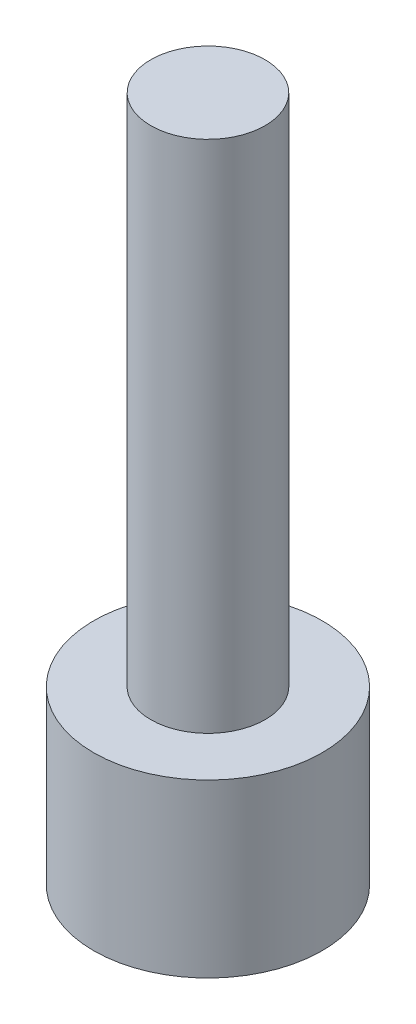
ISO-10303-21;
HEADER;
FILE_DESCRIPTION(('STEP AP214'),'2;1');
FILE_NAME('part.step','',(''),(''),'','','');
FILE_SCHEMA(('AUTOMOTIVE_DESIGN { 1 0 10303 214 1 1 1 1 }'));
ENDSEC;
DATA;
#1=APPLICATION_CONTEXT('core data for automotive mechanical design processes');
#2=APPLICATION_PROTOCOL_DEFINITION('international standard','automotive_design',2000,#1);
#3=PRODUCT_CONTEXT('',#1,'mechanical');
#4=PRODUCT('Part','Part','',(#3));
#5=PRODUCT_RELATED_PRODUCT_CATEGORY('part','',(#4));
#6=PRODUCT_DEFINITION_FORMATION('','',#4);
#7=PRODUCT_DEFINITION_CONTEXT('part definition',#1,'design');
#8=PRODUCT_DEFINITION('design','',#6,#7);
#9=PRODUCT_DEFINITION_SHAPE('','',#8);
#10=(LENGTH_UNIT() NAMED_UNIT(*) SI_UNIT(.MILLI.,.METRE.));
#11=(NAMED_UNIT(*) PLANE_ANGLE_UNIT() SI_UNIT($,.RADIAN.));
#12=(NAMED_UNIT(*) SI_UNIT($,.STERADIAN.) SOLID_ANGLE_UNIT());
#13=UNCERTAINTY_MEASURE_WITH_UNIT(LENGTH_MEASURE(1.E-05),#10,'distance_accuracy_value','');
#14=(GEOMETRIC_REPRESENTATION_CONTEXT(3) GLOBAL_UNCERTAINTY_ASSIGNED_CONTEXT((#13)) GLOBAL_UNIT_ASSIGNED_CONTEXT((#10,
#11,#12)) REPRESENTATION_CONTEXT('',''));
#15=CARTESIAN_POINT('',(0.,0.,0.));
#16=DIRECTION('',(0.,0.,1.));
#17=DIRECTION('',(1.,0.,0.));
#18=AXIS2_PLACEMENT_3D('',#15,#16,#17);
#19=CARTESIAN_POINT('',(0.,3.,0.));
#20=DIRECTION('',(0.,1.,0.));
#21=DIRECTION('',(0.,0.,1.));
#22=AXIS2_PLACEMENT_3D('',#19,#20,#21);
#23=PLANE('',#22);
#24=CARTESIAN_POINT('',(0.,3.,0.));
#25=DIRECTION('',(0.,1.,0.));
#26=DIRECTION('',(0.,0.,1.));
#27=AXIS2_PLACEMENT_3D('',#24,#25,#26);
#28=CIRCLE('',#27,2.);
#29=CARTESIAN_POINT('',(0.,3.,2.));
#30=VERTEX_POINT('',#29);
#31=EDGE_CURVE('E10',#30,#30,#28,.T.);
#32=ORIENTED_EDGE('',*,*,#31,.T.);
#33=EDGE_LOOP('',(#32));
#34=FACE_BOUND('',#33,.T.);
#35=CARTESIAN_POINT('',(0.,3.,0.));
#36=DIRECTION('',(0.,1.,0.));
#37=DIRECTION('',(0.,0.,1.));
#38=AXIS2_PLACEMENT_3D('',#35,#36,#37);
#39=CIRCLE('',#38,1.);
#40=CARTESIAN_POINT('',(0.,3.,1.));
#41=VERTEX_POINT('',#40);
#42=EDGE_CURVE('E45',#41,#41,#39,.T.);
#43=ORIENTED_EDGE('',*,*,#42,.F.);
#44=EDGE_LOOP('',(#43));
#45=FACE_BOUND('',#44,.T.);
#46=ADVANCED_FACE('F30',(#34,#45),#23,.T.);
#47=CARTESIAN_POINT('',(0.,3.,0.));
#48=DIRECTION('',(0.,-1.,0.));
#49=DIRECTION('',(0.,0.,-1.));
#50=AXIS2_PLACEMENT_3D('',#47,#48,#49);
#51=CYLINDRICAL_SURFACE('',#50,2.);
#52=ORIENTED_EDGE('',*,*,#31,.F.);
#53=EDGE_LOOP('',(#52));
#54=FACE_BOUND('',#53,.T.);
#55=CARTESIAN_POINT('',(0.,0.,0.));
#56=DIRECTION('',(0.,1.,0.));
#57=DIRECTION('',(0.,0.,1.));
#58=AXIS2_PLACEMENT_3D('',#55,#56,#57);
#59=CIRCLE('',#58,2.);
#60=CARTESIAN_POINT('',(0.,0.,2.));
#61=VERTEX_POINT('',#60);
#62=EDGE_CURVE('E37',#61,#61,#59,.T.);
#63=ORIENTED_EDGE('',*,*,#62,.T.);
#64=EDGE_LOOP('',(#63));
#65=FACE_BOUND('',#64,.T.);
#66=ADVANCED_FACE('F32',(#54,#65),#51,.T.);
#67=CARTESIAN_POINT('',(0.,0.,0.));
#68=DIRECTION('',(0.,1.,0.));
#69=DIRECTION('',(0.,0.,1.));
#70=AXIS2_PLACEMENT_3D('',#67,#68,#69);
#71=PLANE('',#70);
#72=ORIENTED_EDGE('',*,*,#62,.F.);
#73=EDGE_LOOP('',(#72));
#74=FACE_BOUND('',#73,.T.);
#75=ADVANCED_FACE('F57',(#74),#71,.F.);
#76=CARTESIAN_POINT('',(0.,12.,0.));
#77=DIRECTION('',(0.,-1.,0.));
#78=DIRECTION('',(0.,0.,-1.));
#79=AXIS2_PLACEMENT_3D('',#76,#77,#78);
#80=CYLINDRICAL_SURFACE('',#79,1.);
#81=CARTESIAN_POINT('',(0.,12.,0.));
#82=DIRECTION('',(0.,1.,0.));
#83=DIRECTION('',(0.,0.,1.));
#84=AXIS2_PLACEMENT_3D('',#81,#82,#83);
#85=CIRCLE('',#84,1.);
#86=CARTESIAN_POINT('',(0.,12.,1.));
#87=VERTEX_POINT('',#86);
#88=EDGE_CURVE('E41',#87,#87,#85,.T.);
#89=ORIENTED_EDGE('',*,*,#88,.F.);
#90=EDGE_LOOP('',(#89));
#91=FACE_BOUND('',#90,.T.);
#92=ORIENTED_EDGE('',*,*,#42,.T.);
#93=EDGE_LOOP('',(#92));
#94=FACE_BOUND('',#93,.T.);
#95=ADVANCED_FACE('F51',(#91,#94),#80,.T.);
#96=CARTESIAN_POINT('',(0.,12.,0.));
#97=DIRECTION('',(0.,1.,0.));
#98=DIRECTION('',(0.,0.,1.));
#99=AXIS2_PLACEMENT_3D('',#96,#97,#98);
#100=PLANE('',#99);
#101=ORIENTED_EDGE('',*,*,#88,.T.);
#102=EDGE_LOOP('',(#101));
#103=FACE_BOUND('',#102,.T.);
#104=ADVANCED_FACE('F65',(#103),#100,.T.);
#105=CLOSED_SHELL('',(#46,#66,#75,#95,#104));
#106=MANIFOLD_SOLID_BREP('B2',#105);
#107=ADVANCED_BREP_SHAPE_REPRESENTATION('',(#18,#106),#14);
#108=SHAPE_DEFINITION_REPRESENTATION(#9,#107);
ENDSEC;
END-ISO-10303-21;
